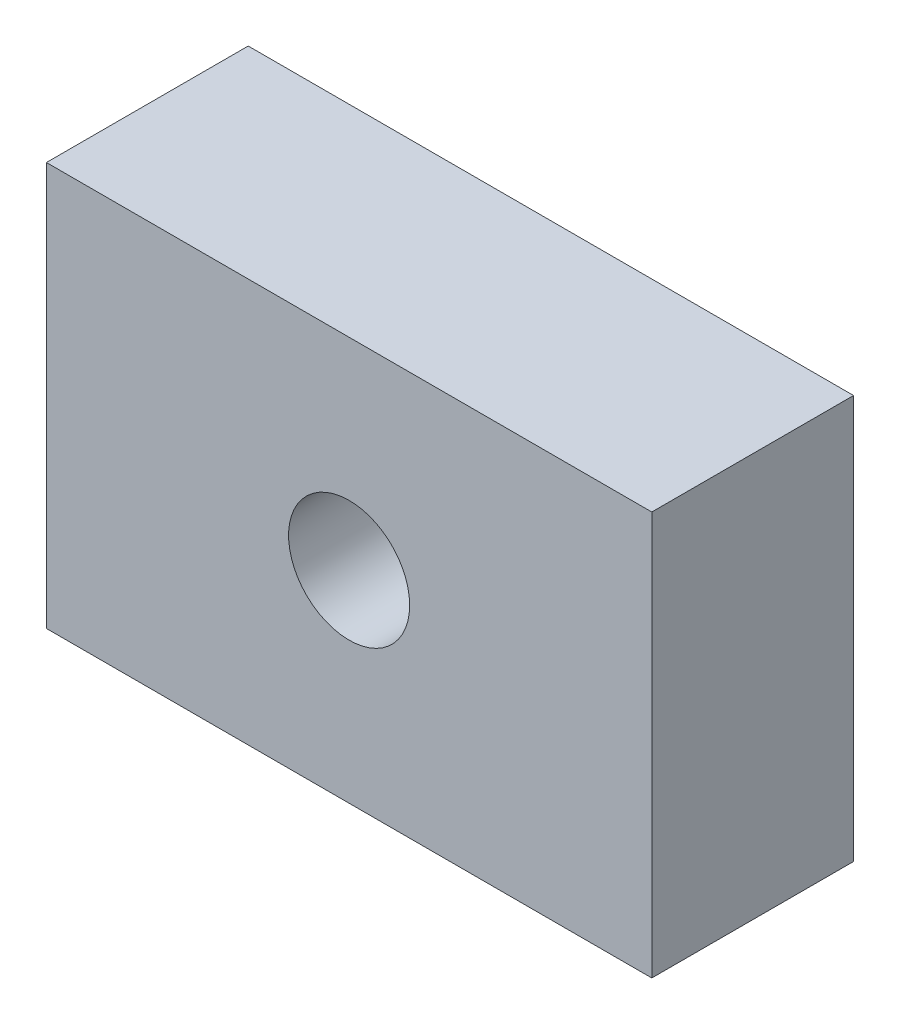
from build123d import *

# Parameters (mm, degrees)
SZKIC1_W               = 200
SZKIC1_H               = 133.333333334
PROSTOPAD_O_CIAN_DEPTH = 66.666666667
SZKIC2_R               = 20
OTW_R_DEPTH            = 138.436854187


with BuildPart() as part:
    # Szkic1 → Prostopad_o_cian (new body)
    with BuildSketch(Plane.XY):
        Rectangle(SZKIC1_W, SZKIC1_H)
    extrude(amount=PROSTOPAD_O_CIAN_DEPTH)

    # Szkic2 → Otw_r (cut, through all)
    with BuildSketch(Plane.XY.offset(66.666666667)):
        Circle(SZKIC2_R)
    extrude(amount=-OTW_R_DEPTH, mode=Mode.SUBTRACT)


solid = part.part
